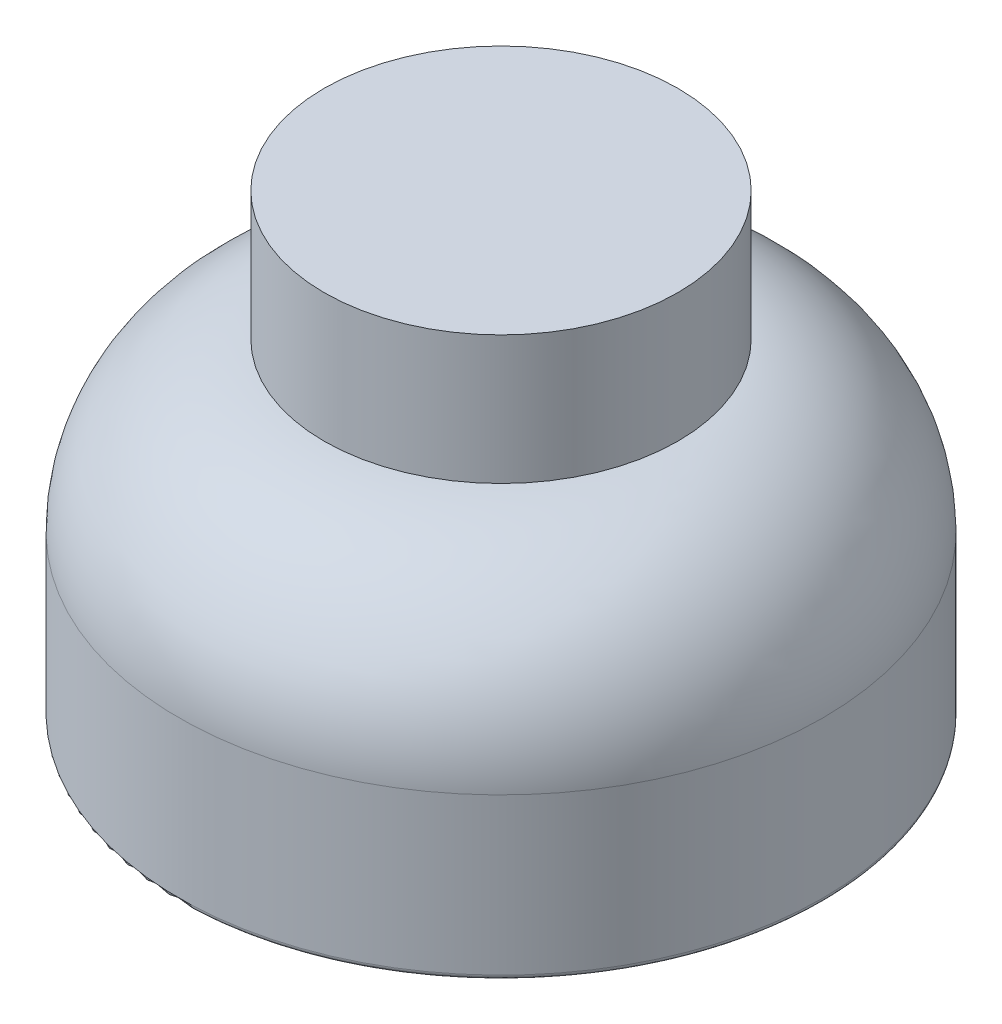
ISO-10303-21;
HEADER;
FILE_DESCRIPTION(('STEP AP214'),'2;1');
FILE_NAME('part.step','',(''),(''),'','','');
FILE_SCHEMA(('AUTOMOTIVE_DESIGN { 1 0 10303 214 1 1 1 1 }'));
ENDSEC;
DATA;
#1=APPLICATION_CONTEXT('core data for automotive mechanical design processes');
#2=APPLICATION_PROTOCOL_DEFINITION('international standard','automotive_design',2000,#1);
#3=PRODUCT_CONTEXT('',#1,'mechanical');
#4=PRODUCT('Part','Part','',(#3));
#5=PRODUCT_RELATED_PRODUCT_CATEGORY('part','',(#4));
#6=PRODUCT_DEFINITION_FORMATION('','',#4);
#7=PRODUCT_DEFINITION_CONTEXT('part definition',#1,'design');
#8=PRODUCT_DEFINITION('design','',#6,#7);
#9=PRODUCT_DEFINITION_SHAPE('','',#8);
#10=(LENGTH_UNIT() NAMED_UNIT(*) SI_UNIT(.MILLI.,.METRE.));
#11=(NAMED_UNIT(*) PLANE_ANGLE_UNIT() SI_UNIT($,.RADIAN.));
#12=(NAMED_UNIT(*) SI_UNIT($,.STERADIAN.) SOLID_ANGLE_UNIT());
#13=UNCERTAINTY_MEASURE_WITH_UNIT(LENGTH_MEASURE(1.E-05),#10,'distance_accuracy_value','');
#14=(GEOMETRIC_REPRESENTATION_CONTEXT(3) GLOBAL_UNCERTAINTY_ASSIGNED_CONTEXT((#13)) GLOBAL_UNIT_ASSIGNED_CONTEXT((#10,
#11,#12)) REPRESENTATION_CONTEXT('',''));
#15=CARTESIAN_POINT('',(0.,0.,0.));
#16=DIRECTION('',(0.,0.,1.));
#17=DIRECTION('',(1.,0.,0.));
#18=AXIS2_PLACEMENT_3D('',#15,#16,#17);
#19=CARTESIAN_POINT('',(0.,32.,0.));
#20=DIRECTION('',(0.,-1.,0.));
#21=DIRECTION('',(0.,0.,-1.));
#22=AXIS2_PLACEMENT_3D('',#19,#20,#21);
#23=CYLINDRICAL_SURFACE('',#22,50.);
#24=CARTESIAN_POINT('',(0.,32.,0.));
#25=DIRECTION('',(0.,1.,0.));
#26=DIRECTION('',(0.,0.,1.));
#27=AXIS2_PLACEMENT_3D('',#24,#25,#26);
#28=CIRCLE('',#27,50.);
#29=CARTESIAN_POINT('',(0.,32.,50.));
#30=VERTEX_POINT('',#29);
#31=EDGE_CURVE('E11',#30,#30,#28,.T.);
#32=ORIENTED_EDGE('',*,*,#31,.F.);
#33=EDGE_LOOP('',(#32));
#34=FACE_BOUND('',#33,.T.);
#35=CARTESIAN_POINT('',(0.,30.,0.));
#36=DIRECTION('',(0.,1.,0.));
#37=DIRECTION('',(0.,0.,1.));
#38=AXIS2_PLACEMENT_3D('',#35,#36,#37);
#39=CIRCLE('',#38,50.);
#40=CARTESIAN_POINT('',(0.,30.,50.));
#41=VERTEX_POINT('',#40);
#42=EDGE_CURVE('E53',#41,#41,#39,.T.);
#43=ORIENTED_EDGE('',*,*,#42,.T.);
#44=EDGE_LOOP('',(#43));
#45=FACE_BOUND('',#44,.T.);
#46=ADVANCED_FACE('F50',(#34,#45),#23,.T.);
#47=CARTESIAN_POINT('',(0.,30.,0.));
#48=DIRECTION('',(0.,1.,0.));
#49=DIRECTION('',(0.,0.,1.));
#50=AXIS2_PLACEMENT_3D('',#47,#48,#49);
#51=PLANE('',#50);
#52=ORIENTED_EDGE('',*,*,#42,.F.);
#53=EDGE_LOOP('',(#52));
#54=FACE_BOUND('',#53,.T.);
#55=ADVANCED_FACE('F77',(#54),#51,.F.);
#56=CARTESIAN_POINT('',(0.,72.,0.));
#57=DIRECTION('',(0.,-1.,0.));
#58=DIRECTION('',(0.,0.,-1.));
#59=AXIS2_PLACEMENT_3D('',#56,#57,#58);
#60=CYLINDRICAL_SURFACE('',#59,54.991);
#61=CARTESIAN_POINT('',(0.,72.,0.));
#62=DIRECTION('',(0.,1.,0.));
#63=DIRECTION('',(0.,0.,1.));
#64=AXIS2_PLACEMENT_3D('',#61,#62,#63);
#65=CIRCLE('',#64,54.991);
#66=CARTESIAN_POINT('',(0.,72.,54.991));
#67=VERTEX_POINT('',#66);
#68=EDGE_CURVE('E62',#67,#67,#65,.T.);
#69=ORIENTED_EDGE('',*,*,#68,.F.);
#70=EDGE_LOOP('',(#69));
#71=FACE_BOUND('',#70,.T.);
#72=CARTESIAN_POINT('',(0.,32.,0.));
#73=DIRECTION('',(0.,1.,0.));
#74=DIRECTION('',(0.,0.,1.));
#75=AXIS2_PLACEMENT_3D('',#72,#73,#74);
#76=CIRCLE('',#75,54.991);
#77=CARTESIAN_POINT('',(0.,32.,54.991));
#78=VERTEX_POINT('',#77);
#79=EDGE_CURVE('E64',#78,#78,#76,.T.);
#80=ORIENTED_EDGE('',*,*,#79,.T.);
#81=EDGE_LOOP('',(#80));
#82=FACE_BOUND('',#81,.T.);
#83=ADVANCED_FACE('F74',(#71,#82),#60,.T.);
#84=CARTESIAN_POINT('',(0.,72.,0.));
#85=DIRECTION('',(0.,1.,0.));
#86=DIRECTION('',(0.,0.,1.));
#87=AXIS2_PLACEMENT_3D('',#84,#85,#86);
#88=PLANE('',#87);
#89=ORIENTED_EDGE('',*,*,#68,.T.);
#90=EDGE_LOOP('',(#89));
#91=FACE_BOUND('',#90,.T.);
#92=ADVANCED_FACE('F72',(#91),#88,.T.);
#93=CARTESIAN_POINT('',(0.,32.,0.));
#94=DIRECTION('',(0.,1.,0.));
#95=DIRECTION('',(0.,0.,1.));
#96=AXIS2_PLACEMENT_3D('',#93,#94,#95);
#97=PLANE('',#96);
#98=ORIENTED_EDGE('',*,*,#31,.T.);
#99=EDGE_LOOP('',(#98));
#100=FACE_BOUND('',#99,.T.);
#101=ORIENTED_EDGE('',*,*,#79,.F.);
#102=EDGE_LOOP('',(#101));
#103=FACE_BOUND('',#102,.T.);
#104=ADVANCED_FACE('F81',(#100,#103),#97,.F.);
#105=CLOSED_SHELL('',(#46,#55,#83,#92,#104));
#106=MANIFOLD_SOLID_BREP('B2',#105);
#107=CARTESIAN_POINT('',(0.,-10.,0.));
#108=DIRECTION('',(0.,1.,0.));
#109=DIRECTION('',(0.,0.,1.));
#110=AXIS2_PLACEMENT_3D('',#107,#108,#109);
#111=CYLINDRICAL_SURFACE('',#110,50.);
#112=CARTESIAN_POINT('',(0.,0.,0.));
#113=DIRECTION('',(0.,-1.,0.));
#114=DIRECTION('',(0.,0.,-1.));
#115=AXIS2_PLACEMENT_3D('',#112,#113,#114);
#116=CIRCLE('',#115,50.);
#117=CARTESIAN_POINT('',(0.,0.,-50.));
#118=VERTEX_POINT('',#117);
#119=EDGE_CURVE('E49',#118,#118,#116,.F.);
#120=ORIENTED_EDGE('',*,*,#119,.T.);
#121=EDGE_LOOP('',(#120));
#122=FACE_BOUND('',#121,.T.);
#123=CARTESIAN_POINT('',(0.,5.,0.));
#124=DIRECTION('',(0.,-1.,0.));
#125=DIRECTION('',(0.,0.,-1.));
#126=AXIS2_PLACEMENT_3D('',#123,#124,#125);
#127=CIRCLE('',#126,50.);
#128=CARTESIAN_POINT('',(0.,5.,-50.));
#129=VERTEX_POINT('',#128);
#130=EDGE_CURVE('E150',#129,#129,#127,.T.);
#131=ORIENTED_EDGE('',*,*,#130,.T.);
#132=EDGE_LOOP('',(#131));
#133=FACE_BOUND('',#132,.T.);
#134=ADVANCED_FACE('F139',(#122,#133),#111,.T.);
#135=CARTESIAN_POINT('',(0.,-10.,0.));
#136=DIRECTION('',(0.,-1.,0.));
#137=DIRECTION('',(0.,0.,-1.));
#138=AXIS2_PLACEMENT_3D('',#135,#136,#137);
#139=PLANE('',#138);
#140=CARTESIAN_POINT('',(0.,-10.,0.));
#141=DIRECTION('',(0.,-1.,0.));
#142=DIRECTION('',(0.,0.,-1.));
#143=AXIS2_PLACEMENT_3D('',#140,#141,#142);
#144=CIRCLE('',#143,40.);
#145=CARTESIAN_POINT('',(0.,-10.,-40.));
#146=VERTEX_POINT('',#145);
#147=EDGE_CURVE('E146',#146,#146,#144,.T.);
#148=ORIENTED_EDGE('',*,*,#147,.T.);
#149=EDGE_LOOP('',(#148));
#150=FACE_BOUND('',#149,.T.);
#151=ADVANCED_FACE('F160',(#150),#139,.T.);
#152=CARTESIAN_POINT('',(0.,5.,0.));
#153=DIRECTION('',(0.,-1.,0.));
#154=DIRECTION('',(0.,0.,-1.));
#155=AXIS2_PLACEMENT_3D('',#152,#153,#154);
#156=PLANE('',#155);
#157=ORIENTED_EDGE('',*,*,#130,.F.);
#158=EDGE_LOOP('',(#157));
#159=FACE_BOUND('',#158,.T.);
#160=ADVANCED_FACE('F158',(#159),#156,.F.);
#161=CARTESIAN_POINT('',(0.,0.,0.));
#162=DIRECTION('',(0.,-1.,0.));
#163=DIRECTION('',(0.,0.,-1.));
#164=AXIS2_PLACEMENT_3D('',#161,#162,#163);
#165=TOROIDAL_SURFACE('',#164,40.,10.);
#166=ORIENTED_EDGE('',*,*,#119,.F.);
#167=EDGE_LOOP('',(#166));
#168=FACE_BOUND('',#167,.T.);
#169=ORIENTED_EDGE('',*,*,#147,.F.);
#170=EDGE_LOOP('',(#169));
#171=FACE_BOUND('',#170,.T.);
#172=ADVANCED_FACE('F141',(#168,#171),#165,.T.);
#173=CLOSED_SHELL('',(#134,#151,#160,#172));
#174=MANIFOLD_SOLID_BREP('B6',#173);
#175=CARTESIAN_POINT('',(0.,5.,0.));
#176=DIRECTION('',(0.,1.,0.));
#177=DIRECTION('',(0.,0.,1.));
#178=AXIS2_PLACEMENT_3D('',#175,#176,#177);
#179=CYLINDRICAL_SURFACE('',#178,50.);
#180=CARTESIAN_POINT('',(0.,5.,0.));
#181=DIRECTION('',(0.,-1.,0.));
#182=DIRECTION('',(0.,0.,-1.));
#183=AXIS2_PLACEMENT_3D('',#180,#181,#182);
#184=CIRCLE('',#183,50.);
#185=CARTESIAN_POINT('',(0.,5.,-50.));
#186=VERTEX_POINT('',#185);
#187=EDGE_CURVE('E138',#186,#186,#184,.T.);
#188=ORIENTED_EDGE('',*,*,#187,.F.);
#189=EDGE_LOOP('',(#188));
#190=FACE_BOUND('',#189,.T.);
#191=CARTESIAN_POINT('',(0.,25.,0.));
#192=DIRECTION('',(0.,-1.,0.));
#193=DIRECTION('',(0.,0.,-1.));
#194=AXIS2_PLACEMENT_3D('',#191,#192,#193);
#195=CIRCLE('',#194,50.);
#196=CARTESIAN_POINT('',(0.,25.,-50.));
#197=VERTEX_POINT('',#196);
#198=EDGE_CURVE('E206',#197,#197,#195,.T.);
#199=ORIENTED_EDGE('',*,*,#198,.T.);
#200=EDGE_LOOP('',(#199));
#201=FACE_BOUND('',#200,.T.);
#202=ADVANCED_FACE('F203',(#190,#201),#179,.T.);
#203=CARTESIAN_POINT('',(0.,5.,0.));
#204=DIRECTION('',(0.,-1.,0.));
#205=DIRECTION('',(0.,0.,-1.));
#206=AXIS2_PLACEMENT_3D('',#203,#204,#205);
#207=PLANE('',#206);
#208=ORIENTED_EDGE('',*,*,#187,.T.);
#209=EDGE_LOOP('',(#208));
#210=FACE_BOUND('',#209,.T.);
#211=ADVANCED_FACE('F218',(#210),#207,.T.);
#212=CARTESIAN_POINT('',(0.,25.,0.));
#213=DIRECTION('',(0.,-1.,0.));
#214=DIRECTION('',(0.,0.,-1.));
#215=AXIS2_PLACEMENT_3D('',#212,#213,#214);
#216=PLANE('',#215);
#217=ORIENTED_EDGE('',*,*,#198,.F.);
#218=EDGE_LOOP('',(#217));
#219=FACE_BOUND('',#218,.T.);
#220=ADVANCED_FACE('F216',(#219),#216,.F.);
#221=CLOSED_SHELL('',(#202,#211,#220));
#222=MANIFOLD_SOLID_BREP('B44',#221);
#223=CARTESIAN_POINT('',(0.,25.,0.));
#224=DIRECTION('',(0.,1.,0.));
#225=DIRECTION('',(0.,0.,1.));
#226=AXIS2_PLACEMENT_3D('',#223,#224,#225);
#227=CYLINDRICAL_SURFACE('',#226,50.);
#228=CARTESIAN_POINT('',(0.,25.,0.));
#229=DIRECTION('',(0.,-1.,0.));
#230=DIRECTION('',(0.,0.,-1.));
#231=AXIS2_PLACEMENT_3D('',#228,#229,#230);
#232=CIRCLE('',#231,50.);
#233=CARTESIAN_POINT('',(0.,25.,-50.));
#234=VERTEX_POINT('',#233);
#235=EDGE_CURVE('E202',#234,#234,#232,.T.);
#236=ORIENTED_EDGE('',*,*,#235,.F.);
#237=EDGE_LOOP('',(#236));
#238=FACE_BOUND('',#237,.T.);
#239=CARTESIAN_POINT('',(0.,27.,0.));
#240=DIRECTION('',(0.,-1.,0.));
#241=DIRECTION('',(0.,0.,-1.));
#242=AXIS2_PLACEMENT_3D('',#239,#240,#241);
#243=CIRCLE('',#242,50.);
#244=CARTESIAN_POINT('',(0.,27.,-50.));
#245=VERTEX_POINT('',#244);
#246=EDGE_CURVE('E254',#245,#245,#243,.T.);
#247=ORIENTED_EDGE('',*,*,#246,.T.);
#248=EDGE_LOOP('',(#247));
#249=FACE_BOUND('',#248,.T.);
#250=ADVANCED_FACE('F251',(#238,#249),#227,.T.);
#251=CARTESIAN_POINT('',(0.,25.,0.));
#252=DIRECTION('',(0.,-1.,0.));
#253=DIRECTION('',(0.,0.,-1.));
#254=AXIS2_PLACEMENT_3D('',#251,#252,#253);
#255=PLANE('',#254);
#256=ORIENTED_EDGE('',*,*,#235,.T.);
#257=EDGE_LOOP('',(#256));
#258=FACE_BOUND('',#257,.T.);
#259=ADVANCED_FACE('F266',(#258),#255,.T.);
#260=CARTESIAN_POINT('',(0.,27.,0.));
#261=DIRECTION('',(0.,-1.,0.));
#262=DIRECTION('',(0.,0.,-1.));
#263=AXIS2_PLACEMENT_3D('',#260,#261,#262);
#264=PLANE('',#263);
#265=ORIENTED_EDGE('',*,*,#246,.F.);
#266=EDGE_LOOP('',(#265));
#267=FACE_BOUND('',#266,.T.);
#268=ADVANCED_FACE('F264',(#267),#264,.F.);
#269=CLOSED_SHELL('',(#250,#259,#268));
#270=MANIFOLD_SOLID_BREP('B133',#269);
#271=CARTESIAN_POINT('',(50.,30.,0.));
#272=DIRECTION('',(0.,-1.,0.));
#273=DIRECTION('',(1.,0.,0.));
#274=AXIS2_PLACEMENT_3D('',#271,#272,#273);
#275=PLANE('',#274);
#276=CARTESIAN_POINT('',(0.,30.,0.));
#277=DIRECTION('',(0.,1.,0.));
#278=DIRECTION('',(-1.,0.,0.));
#279=AXIS2_PLACEMENT_3D('',#276,#277,#278);
#280=CIRCLE('',#279,50.);
#281=CARTESIAN_POINT('',(-50.,30.,0.));
#282=VERTEX_POINT('',#281);
#283=EDGE_CURVE('E304',#282,#282,#280,.T.);
#284=ORIENTED_EDGE('',*,*,#283,.T.);
#285=EDGE_LOOP('',(#284));
#286=FACE_BOUND('',#285,.T.);
#287=ADVANCED_FACE('F292',(#286),#275,.F.);
#288=CARTESIAN_POINT('',(0.,-20.,0.));
#289=DIRECTION('',(0.,1.,0.));
#290=DIRECTION('',(-1.,0.,0.));
#291=AXIS2_PLACEMENT_3D('',#288,#289,#290);
#292=DEGENERATE_TOROIDAL_SURFACE('',#291,50.,50.,.T.);
#293=ORIENTED_EDGE('',*,*,#283,.F.);
#294=EDGE_LOOP('',(#293));
#295=FACE_BOUND('',#294,.T.);
#296=CARTESIAN_POINT('',(0.,-20.,0.));
#297=DIRECTION('',(0.,1.,0.));
#298=DIRECTION('',(-1.,0.,0.));
#299=AXIS2_PLACEMENT_3D('',#296,#297,#298);
#300=CIRCLE('',#299,100.);
#301=CARTESIAN_POINT('',(-100.,-20.,0.));
#302=VERTEX_POINT('',#301);
#303=EDGE_CURVE('E309',#302,#302,#300,.T.);
#304=ORIENTED_EDGE('',*,*,#303,.T.);
#305=EDGE_LOOP('',(#304));
#306=FACE_BOUND('',#305,.T.);
#307=ADVANCED_FACE('F332',(#295,#306),#292,.T.);
#308=CARTESIAN_POINT('',(0.,30.,0.));
#309=DIRECTION('',(0.,1.,0.));
#310=DIRECTION('',(-1.,0.,0.));
#311=AXIS2_PLACEMENT_3D('',#308,#309,#310);
#312=CYLINDRICAL_SURFACE('',#311,100.);
#313=CARTESIAN_POINT('',(0.,-68.5,0.));
#314=DIRECTION('',(0.,1.,0.));
#315=DIRECTION('',(-1.,0.,0.));
#316=AXIS2_PLACEMENT_3D('',#313,#314,#315);
#317=CIRCLE('',#316,100.);
#318=CARTESIAN_POINT('',(-100.,-68.5,0.));
#319=VERTEX_POINT('',#318);
#320=EDGE_CURVE('E300',#319,#319,#317,.T.);
#321=ORIENTED_EDGE('',*,*,#320,.T.);
#322=EDGE_LOOP('',(#321));
#323=FACE_BOUND('',#322,.T.);
#324=ORIENTED_EDGE('',*,*,#303,.F.);
#325=EDGE_LOOP('',(#324));
#326=FACE_BOUND('',#325,.T.);
#327=ADVANCED_FACE('F324',(#323,#326),#312,.T.);
#328=CARTESIAN_POINT('',(50.,27.,0.));
#329=DIRECTION('',(0.,-1.,0.));
#330=DIRECTION('',(1.,0.,0.));
#331=AXIS2_PLACEMENT_3D('',#328,#329,#330);
#332=PLANE('',#331);
#333=CARTESIAN_POINT('',(0.,27.,0.));
#334=DIRECTION('',(0.,1.,0.));
#335=DIRECTION('',(-1.,0.,0.));
#336=AXIS2_PLACEMENT_3D('',#333,#334,#335);
#337=CIRCLE('',#336,50.);
#338=CARTESIAN_POINT('',(-50.,27.,0.));
#339=VERTEX_POINT('',#338);
#340=EDGE_CURVE('E312',#339,#339,#337,.T.);
#341=ORIENTED_EDGE('',*,*,#340,.F.);
#342=EDGE_LOOP('',(#341));
#343=FACE_BOUND('',#342,.T.);
#344=ADVANCED_FACE('F322',(#343),#332,.T.);
#345=CARTESIAN_POINT('',(0.,-20.,0.));
#346=DIRECTION('',(0.,1.,0.));
#347=DIRECTION('',(-1.,0.,0.));
#348=AXIS2_PLACEMENT_3D('',#345,#346,#347);
#349=TOROIDAL_SURFACE('',#348,50.,47.);
#350=ORIENTED_EDGE('',*,*,#340,.T.);
#351=EDGE_LOOP('',(#350));
#352=FACE_BOUND('',#351,.T.);
#353=CARTESIAN_POINT('',(0.,-20.,0.));
#354=DIRECTION('',(0.,1.,0.));
#355=DIRECTION('',(-1.,0.,0.));
#356=AXIS2_PLACEMENT_3D('',#353,#354,#355);
#357=CIRCLE('',#356,97.);
#358=CARTESIAN_POINT('',(-97.,-20.,0.));
#359=VERTEX_POINT('',#358);
#360=EDGE_CURVE('E313',#359,#359,#357,.T.);
#361=ORIENTED_EDGE('',*,*,#360,.F.);
#362=EDGE_LOOP('',(#361));
#363=FACE_BOUND('',#362,.T.);
#364=ADVANCED_FACE('F319',(#352,#363),#349,.F.);
#365=CARTESIAN_POINT('',(0.,30.,0.));
#366=DIRECTION('',(0.,1.,0.));
#367=DIRECTION('',(-1.,0.,0.));
#368=AXIS2_PLACEMENT_3D('',#365,#366,#367);
#369=CYLINDRICAL_SURFACE('',#368,97.);
#370=CARTESIAN_POINT('',(0.,-68.5,0.));
#371=DIRECTION('',(0.,1.,0.));
#372=DIRECTION('',(-1.,0.,0.));
#373=AXIS2_PLACEMENT_3D('',#370,#371,#372);
#374=CIRCLE('',#373,97.);
#375=CARTESIAN_POINT('',(-97.,-68.5,0.));
#376=VERTEX_POINT('',#375);
#377=EDGE_CURVE('E250',#376,#376,#374,.F.);
#378=ORIENTED_EDGE('',*,*,#377,.T.);
#379=EDGE_LOOP('',(#378));
#380=FACE_BOUND('',#379,.T.);
#381=ORIENTED_EDGE('',*,*,#360,.T.);
#382=EDGE_LOOP('',(#381));
#383=FACE_BOUND('',#382,.T.);
#384=ADVANCED_FACE('F330',(#380,#383),#369,.F.);
#385=CARTESIAN_POINT('',(0.,-68.5,0.));
#386=DIRECTION('',(0.,1.,0.));
#387=DIRECTION('',(-1.,0.,0.));
#388=AXIS2_PLACEMENT_3D('',#385,#386,#387);
#389=TOROIDAL_SURFACE('',#388,98.5,1.5);
#390=ORIENTED_EDGE('',*,*,#377,.F.);
#391=EDGE_LOOP('',(#390));
#392=FACE_BOUND('',#391,.T.);
#393=CARTESIAN_POINT('',(0.,-70.,0.));
#394=DIRECTION('',(0.,1.,0.));
#395=DIRECTION('',(-1.,0.,0.));
#396=AXIS2_PLACEMENT_3D('',#393,#394,#395);
#397=CIRCLE('',#396,98.5);
#398=CARTESIAN_POINT('',(-98.5,-70.,0.));
#399=VERTEX_POINT('',#398);
#400=EDGE_CURVE('E296',#399,#399,#397,.T.);
#401=ORIENTED_EDGE('',*,*,#400,.F.);
#402=EDGE_LOOP('',(#401));
#403=FACE_BOUND('',#402,.T.);
#404=ADVANCED_FACE('F294',(#392,#403),#389,.T.);
#405=CARTESIAN_POINT('',(0.,-68.5,0.));
#406=DIRECTION('',(0.,1.,0.));
#407=DIRECTION('',(-1.,0.,0.));
#408=AXIS2_PLACEMENT_3D('',#405,#406,#407);
#409=TOROIDAL_SURFACE('',#408,98.5,1.5);
#410=ORIENTED_EDGE('',*,*,#400,.T.);
#411=EDGE_LOOP('',(#410));
#412=FACE_BOUND('',#411,.T.);
#413=ORIENTED_EDGE('',*,*,#320,.F.);
#414=EDGE_LOOP('',(#413));
#415=FACE_BOUND('',#414,.T.);
#416=ADVANCED_FACE('F343',(#412,#415),#409,.T.);
#417=CLOSED_SHELL('',(#287,#307,#327,#344,#364,#384,#404,#416));
#418=MANIFOLD_SOLID_BREP('B197',#417);
#419=ADVANCED_BREP_SHAPE_REPRESENTATION('',(#18,#106,#174,#222,#270,#418),#14);
#420=SHAPE_DEFINITION_REPRESENTATION(#9,#419);
ENDSEC;
END-ISO-10303-21;
